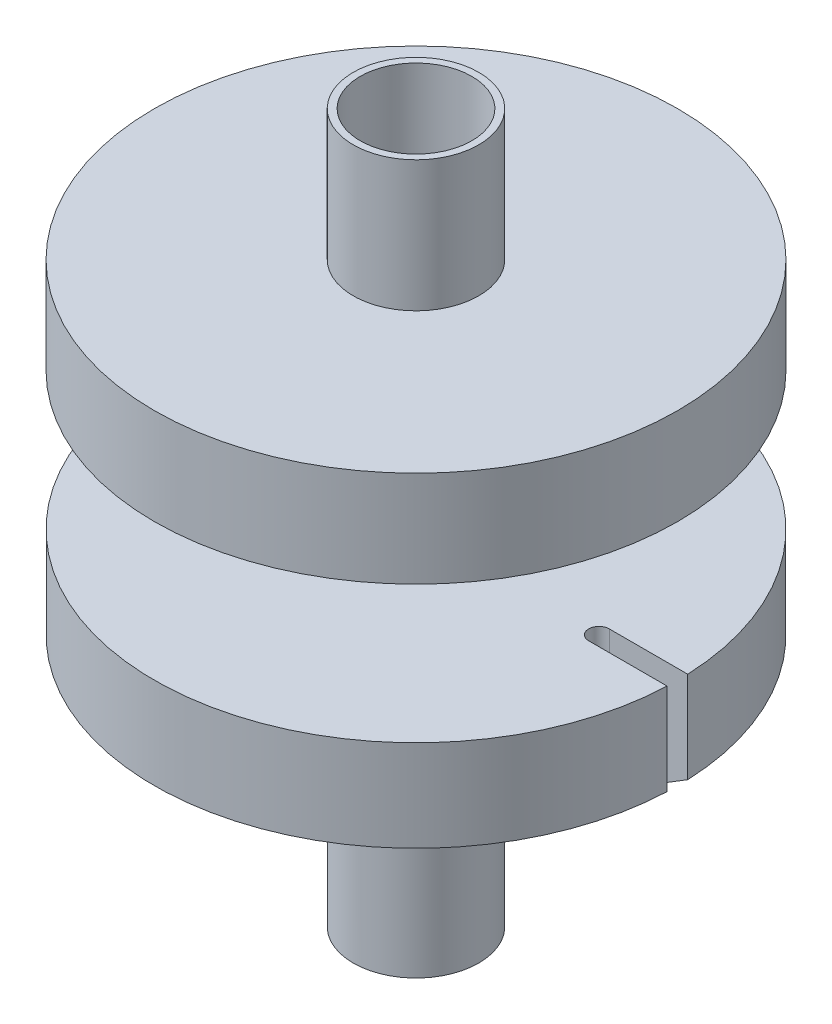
ISO-10303-21;
HEADER;
FILE_DESCRIPTION(('STEP AP214'),'2;1');
FILE_NAME('part.step','',(''),(''),'','','');
FILE_SCHEMA(('AUTOMOTIVE_DESIGN { 1 0 10303 214 1 1 1 1 }'));
ENDSEC;
DATA;
#1=APPLICATION_CONTEXT('core data for automotive mechanical design processes');
#2=APPLICATION_PROTOCOL_DEFINITION('international standard','automotive_design',2000,#1);
#3=PRODUCT_CONTEXT('',#1,'mechanical');
#4=PRODUCT('Part','Part','',(#3));
#5=PRODUCT_RELATED_PRODUCT_CATEGORY('part','',(#4));
#6=PRODUCT_DEFINITION_FORMATION('','',#4);
#7=PRODUCT_DEFINITION_CONTEXT('part definition',#1,'design');
#8=PRODUCT_DEFINITION('design','',#6,#7);
#9=PRODUCT_DEFINITION_SHAPE('','',#8);
#10=(LENGTH_UNIT() NAMED_UNIT(*) SI_UNIT(.MILLI.,.METRE.));
#11=(NAMED_UNIT(*) PLANE_ANGLE_UNIT() SI_UNIT($,.RADIAN.));
#12=(NAMED_UNIT(*) SI_UNIT($,.STERADIAN.) SOLID_ANGLE_UNIT());
#13=UNCERTAINTY_MEASURE_WITH_UNIT(LENGTH_MEASURE(1.E-05),#10,'distance_accuracy_value','');
#14=(GEOMETRIC_REPRESENTATION_CONTEXT(3) GLOBAL_UNCERTAINTY_ASSIGNED_CONTEXT((#13)) GLOBAL_UNIT_ASSIGNED_CONTEXT((#10,
#11,#12)) REPRESENTATION_CONTEXT('',''));
#15=CARTESIAN_POINT('',(0.,0.,0.));
#16=DIRECTION('',(0.,0.,1.));
#17=DIRECTION('',(1.,0.,0.));
#18=AXIS2_PLACEMENT_3D('',#15,#16,#17);
#19=CARTESIAN_POINT('',(5.322,-0.001000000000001,0.));
#20=DIRECTION('',(0.,1.,0.));
#21=DIRECTION('',(0.,0.,1.));
#22=AXIS2_PLACEMENT_3D('',#19,#20,#21);
#23=CYLINDRICAL_SURFACE('',#22,0.750000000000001);
#24=CARTESIAN_POINT('',(5.322,25.075,0.));
#25=DIRECTION('',(0.,1.,0.));
#26=DIRECTION('',(0.,0.,1.));
#27=AXIS2_PLACEMENT_3D('',#24,#25,#26);
#28=CIRCLE('',#27,0.750000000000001);
#29=CARTESIAN_POINT('',(4.73906334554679,25.075,-0.471894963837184));
#30=VERTEX_POINT('',#29);
#31=CARTESIAN_POINT('',(4.73906334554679,25.075,0.471894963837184));
#32=VERTEX_POINT('',#31);
#33=EDGE_CURVE('E400',#30,#32,#28,.T.);
#34=ORIENTED_EDGE('',*,*,#33,.T.);
#35=EDGE_CURVE('E417',#32,#30,#28,.T.);
#36=ORIENTED_EDGE('',*,*,#35,.T.);
#37=EDGE_LOOP('',(#34,#36));
#38=FACE_BOUND('',#37,.T.);
#39=DIRECTION('',(0.,1.,0.));
#40=VECTOR('',#39,1.);
#41=CARTESIAN_POINT('',(5.322,-0.00100000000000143,-0.749999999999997));
#42=LINE('',#41,#40);
#43=CARTESIAN_POINT('',(5.322,13.33998,-0.75));
#44=VERTEX_POINT('',#43);
#45=CARTESIAN_POINT('',(5.322,14.08998,-0.75));
#46=VERTEX_POINT('',#45);
#47=EDGE_CURVE('E372',#44,#46,#42,.T.);
#48=ORIENTED_EDGE('',*,*,#47,.T.);
#49=CARTESIAN_POINT('',(5.322,14.08998,0.));
#50=DIRECTION('',(0.707106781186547,-0.707106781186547,0.));
#51=DIRECTION('',(0.707106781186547,0.707106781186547,0.));
#52=AXIS2_PLACEMENT_3D('',#49,#50,#51);
#53=ELLIPSE('',#52,1.06066017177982,0.750000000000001);
#54=CARTESIAN_POINT('',(5.322,14.08998,0.75));
#55=VERTEX_POINT('',#54);
#56=EDGE_CURVE('E379',#55,#46,#53,.F.);
#57=ORIENTED_EDGE('',*,*,#56,.F.);
#58=DIRECTION('',(0.,1.,0.));
#59=VECTOR('',#58,1.);
#60=CARTESIAN_POINT('',(5.322,-0.00100000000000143,0.749999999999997));
#61=LINE('',#60,#59);
#62=CARTESIAN_POINT('',(5.322,13.33998,0.750000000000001));
#63=VERTEX_POINT('',#62);
#64=EDGE_CURVE('E386',#63,#55,#61,.T.);
#65=ORIENTED_EDGE('',*,*,#64,.F.);
#66=CARTESIAN_POINT('',(5.322,13.33998,0.));
#67=DIRECTION('',(0.,-1.,0.));
#68=DIRECTION('',(0.,0.,-1.));
#69=AXIS2_PLACEMENT_3D('',#66,#67,#68);
#70=CIRCLE('',#69,0.750000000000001);
#71=CARTESIAN_POINT('',(4.572,13.33998,0.));
#72=VERTEX_POINT('',#71);
#73=EDGE_CURVE('E418',#72,#63,#70,.F.);
#74=ORIENTED_EDGE('',*,*,#73,.F.);
#75=EDGE_CURVE('E390',#44,#72,#70,.F.);
#76=ORIENTED_EDGE('',*,*,#75,.F.);
#77=EDGE_LOOP('',(#48,#57,#65,#74,#76));
#78=FACE_BOUND('',#77,.T.);
#79=ADVANCED_FACE('F283',(#38,#78),#23,.F.);
#80=CARTESIAN_POINT('',(0.,51.6,0.));
#81=DIRECTION('',(0.,-1.,0.));
#82=DIRECTION('',(0.,0.,-1.));
#83=AXIS2_PLACEMENT_3D('',#80,#81,#82);
#84=CYLINDRICAL_SURFACE('',#83,4.572);
#85=CARTESIAN_POINT('',(0.,13.33998,0.));
#86=DIRECTION('',(0.,1.,0.));
#87=DIRECTION('',(0.,0.,1.));
#88=AXIS2_PLACEMENT_3D('',#85,#86,#87);
#89=CIRCLE('',#88,4.572);
#90=EDGE_CURVE('E429',#72,#72,#89,.T.);
#91=ORIENTED_EDGE('',*,*,#90,.F.);
#92=EDGE_LOOP('',(#91));
#93=FACE_BOUND('',#92,.T.);
#94=CARTESIAN_POINT('',(0.,0.,0.));
#95=DIRECTION('',(0.,1.,0.));
#96=DIRECTION('',(0.,0.,1.));
#97=AXIS2_PLACEMENT_3D('',#94,#95,#96);
#98=CIRCLE('',#97,4.572);
#99=CARTESIAN_POINT('',(0.,0.,4.572));
#100=VERTEX_POINT('',#99);
#101=EDGE_CURVE('E440',#100,#100,#98,.T.);
#102=ORIENTED_EDGE('',*,*,#101,.T.);
#103=EDGE_LOOP('',(#102));
#104=FACE_BOUND('',#103,.T.);
#105=ADVANCED_FACE('F524',(#93,#104),#84,.T.);
#106=CARTESIAN_POINT('',(0.,25.2655,0.));
#107=DIRECTION('',(0.,1.,0.));
#108=DIRECTION('',(0.,0.,1.));
#109=AXIS2_PLACEMENT_3D('',#106,#107,#108);
#110=CIRCLE('',#109,4.572);
#111=CARTESIAN_POINT('',(0.,25.2655,-4.572));
#112=VERTEX_POINT('',#111);
#113=EDGE_CURVE('E450',#112,#112,#110,.T.);
#114=CARTESIAN_POINT('',(0.,34.8845,0.));
#115=DIRECTION('',(0.,-1.,0.));
#116=DIRECTION('',(0.,0.,-1.));
#117=AXIS2_PLACEMENT_3D('',#114,#115,#116);
#118=CIRCLE('',#117,4.572);
#119=CARTESIAN_POINT('',(0.,34.8845,-4.572));
#120=VERTEX_POINT('',#119);
#121=EDGE_CURVE('E443',#120,#120,#118,.T.);
#122=CARTESIAN_POINT('',(0.,25.2655,-4.572));
#123=CARTESIAN_POINT('',(0.,25.3656979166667,-4.572));
#124=CARTESIAN_POINT('',(0.,25.4658958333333,-4.572));
#125=CARTESIAN_POINT('',(0.,25.6662916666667,-4.572));
#126=CARTESIAN_POINT('',(0.,25.7664895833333,-4.572));
#127=CARTESIAN_POINT('',(0.,25.9668854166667,-4.572));
#128=CARTESIAN_POINT('',(0.,26.0670833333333,-4.572));
#129=CARTESIAN_POINT('',(0.,26.2674791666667,-4.572));
#130=CARTESIAN_POINT('',(0.,26.3676770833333,-4.572));
#131=CARTESIAN_POINT('',(0.,26.5680729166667,-4.572));
#132=CARTESIAN_POINT('',(0.,26.6682708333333,-4.572));
#133=CARTESIAN_POINT('',(0.,26.8686666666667,-4.572));
#134=CARTESIAN_POINT('',(0.,26.9688645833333,-4.572));
#135=CARTESIAN_POINT('',(0.,27.1692604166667,-4.572));
#136=CARTESIAN_POINT('',(0.,27.2694583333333,-4.572));
#137=CARTESIAN_POINT('',(0.,27.4698541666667,-4.572));
#138=CARTESIAN_POINT('',(0.,27.5700520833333,-4.572));
#139=CARTESIAN_POINT('',(0.,27.7704479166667,-4.572));
#140=CARTESIAN_POINT('',(0.,27.8706458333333,-4.572));
#141=CARTESIAN_POINT('',(0.,28.0710416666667,-4.572));
#142=CARTESIAN_POINT('',(0.,28.1712395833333,-4.572));
#143=CARTESIAN_POINT('',(0.,28.3716354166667,-4.572));
#144=CARTESIAN_POINT('',(0.,28.4718333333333,-4.572));
#145=CARTESIAN_POINT('',(0.,28.6722291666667,-4.572));
#146=CARTESIAN_POINT('',(0.,28.7724270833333,-4.572));
#147=CARTESIAN_POINT('',(0.,28.9728229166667,-4.572));
#148=CARTESIAN_POINT('',(0.,29.0730208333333,-4.572));
#149=CARTESIAN_POINT('',(0.,29.2734166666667,-4.572));
#150=CARTESIAN_POINT('',(0.,29.3736145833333,-4.572));
#151=CARTESIAN_POINT('',(0.,29.5740104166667,-4.572));
#152=CARTESIAN_POINT('',(0.,29.6742083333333,-4.572));
#153=CARTESIAN_POINT('',(0.,29.8746041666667,-4.572));
#154=CARTESIAN_POINT('',(0.,29.9748020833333,-4.572));
#155=CARTESIAN_POINT('',(0.,30.1751979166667,-4.572));
#156=CARTESIAN_POINT('',(0.,30.2753958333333,-4.572));
#157=CARTESIAN_POINT('',(0.,30.4757916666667,-4.572));
#158=CARTESIAN_POINT('',(0.,30.5759895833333,-4.572));
#159=CARTESIAN_POINT('',(0.,30.7763854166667,-4.572));
#160=CARTESIAN_POINT('',(0.,30.8765833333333,-4.572));
#161=CARTESIAN_POINT('',(0.,31.0769791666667,-4.572));
#162=CARTESIAN_POINT('',(0.,31.1771770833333,-4.572));
#163=CARTESIAN_POINT('',(0.,31.3775729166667,-4.572));
#164=CARTESIAN_POINT('',(0.,31.4777708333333,-4.572));
#165=CARTESIAN_POINT('',(0.,31.6781666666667,-4.572));
#166=CARTESIAN_POINT('',(0.,31.7783645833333,-4.572));
#167=CARTESIAN_POINT('',(0.,31.9787604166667,-4.572));
#168=CARTESIAN_POINT('',(0.,32.0789583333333,-4.572));
#169=CARTESIAN_POINT('',(0.,32.2793541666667,-4.572));
#170=CARTESIAN_POINT('',(0.,32.3795520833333,-4.572));
#171=CARTESIAN_POINT('',(0.,32.5799479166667,-4.572));
#172=CARTESIAN_POINT('',(0.,32.6801458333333,-4.572));
#173=CARTESIAN_POINT('',(0.,32.8805416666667,-4.572));
#174=CARTESIAN_POINT('',(0.,32.9807395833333,-4.572));
#175=CARTESIAN_POINT('',(0.,33.1811354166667,-4.572));
#176=CARTESIAN_POINT('',(0.,33.2813333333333,-4.572));
#177=CARTESIAN_POINT('',(0.,33.4817291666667,-4.572));
#178=CARTESIAN_POINT('',(0.,33.5819270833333,-4.572));
#179=CARTESIAN_POINT('',(0.,33.7823229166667,-4.572));
#180=CARTESIAN_POINT('',(0.,33.8825208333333,-4.572));
#181=CARTESIAN_POINT('',(0.,34.0829166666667,-4.572));
#182=CARTESIAN_POINT('',(0.,34.1831145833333,-4.572));
#183=CARTESIAN_POINT('',(0.,34.3835104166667,-4.572));
#184=CARTESIAN_POINT('',(0.,34.4837083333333,-4.572));
#185=CARTESIAN_POINT('',(0.,34.6841041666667,-4.572));
#186=CARTESIAN_POINT('',(0.,34.7843020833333,-4.572));
#187=CARTESIAN_POINT('',(0.,34.8845,-4.572));
#188=B_SPLINE_CURVE_WITH_KNOTS('',3,(#122,#123,#124,#125,#126,#127,#128,#129,#130,#131,#132,
#133,#134,#135,#136,#137,#138,#139,#140,#141,#142,#143,#144,#145,#146,#147,#148,#149,#150,#151,
#152,#153,#154,#155,#156,#157,#158,#159,#160,#161,#162,#163,#164,#165,#166,#167,#168,#169,#170,
#171,#172,#173,#174,#175,#176,#177,#178,#179,#180,#181,#182,#183,#184,#185,#186,#187),
.UNSPECIFIED.,.F.,.F.,(4,2,2,2,2,2,2,2,2,2,2,2,2,2,2,2,2,2,2,2,2,2,2,2,2,2,2,2,2,2,2,2,4),(0.,
0.300593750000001,0.601187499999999,0.901781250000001,1.202375,1.50296875,1.8035625,2.10415625,
2.40475,2.70534375,3.0059375,3.30653125,3.607125,3.90771875,4.2083125,4.50890625,4.8095,
5.11009375,5.4106875,5.71128125,6.011875,6.31246875,6.6130625,6.91365625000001,7.21425,
7.51484375,7.8154375,8.11603125,8.41662500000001,8.71721875,9.0178125,9.31840625,9.619),.UNSPECIFIED.);
#189=EDGE_CURVE('BSEAM529',#112,#120,#188,.T.);
#190=ORIENTED_EDGE('',*,*,#113,.T.);
#191=ORIENTED_EDGE('',*,*,#121,.T.);
#192=ORIENTED_EDGE('',*,*,#189,.T.);
#193=ORIENTED_EDGE('',*,*,#189,.F.);
#194=EDGE_LOOP('',(#190,#192,#191,#193));
#195=FACE_BOUND('',#194,.T.);
#196=ADVANCED_FACE('F529',(#195),#84,.T.);
#197=CARTESIAN_POINT('',(0.,51.6,0.));
#198=DIRECTION('',(0.,-1.,0.));
#199=DIRECTION('',(0.,0.,-1.));
#200=AXIS2_PLACEMENT_3D('',#197,#198,#199);
#201=CYLINDRICAL_SURFACE('',#200,4.064);
#202=CARTESIAN_POINT('',(0.,51.6,0.));
#203=DIRECTION('',(0.,1.,0.));
#204=DIRECTION('',(0.,0.,1.));
#205=AXIS2_PLACEMENT_3D('',#202,#203,#204);
#206=CIRCLE('',#205,4.064);
#207=CARTESIAN_POINT('',(0.,51.6,-4.064));
#208=VERTEX_POINT('',#207);
#209=EDGE_CURVE('E436',#208,#208,#206,.T.);
#210=CARTESIAN_POINT('',(0.,0.,0.));
#211=DIRECTION('',(0.,1.,0.));
#212=DIRECTION('',(0.,0.,1.));
#213=AXIS2_PLACEMENT_3D('',#210,#211,#212);
#214=CIRCLE('',#213,4.064);
#215=CARTESIAN_POINT('',(0.,0.,-4.064));
#216=VERTEX_POINT('',#215);
#217=EDGE_CURVE('E435',#216,#216,#214,.T.);
#218=CARTESIAN_POINT('',(0.,51.6,-4.064));
#219=CARTESIAN_POINT('',(0.,51.0625,-4.064));
#220=CARTESIAN_POINT('',(0.,50.525,-4.064));
#221=CARTESIAN_POINT('',(0.,49.45,-4.064));
#222=CARTESIAN_POINT('',(0.,48.9125,-4.064));
#223=CARTESIAN_POINT('',(0.,47.8375,-4.064));
#224=CARTESIAN_POINT('',(0.,47.3,-4.064));
#225=CARTESIAN_POINT('',(0.,46.225,-4.064));
#226=CARTESIAN_POINT('',(0.,45.6875,-4.064));
#227=CARTESIAN_POINT('',(0.,44.6125,-4.064));
#228=CARTESIAN_POINT('',(0.,44.075,-4.064));
#229=CARTESIAN_POINT('',(0.,43.,-4.064));
#230=CARTESIAN_POINT('',(0.,42.4625,-4.064));
#231=CARTESIAN_POINT('',(0.,41.3875,-4.064));
#232=CARTESIAN_POINT('',(0.,40.85,-4.064));
#233=CARTESIAN_POINT('',(0.,39.775,-4.064));
#234=CARTESIAN_POINT('',(0.,39.2375,-4.064));
#235=CARTESIAN_POINT('',(0.,38.1625,-4.064));
#236=CARTESIAN_POINT('',(0.,37.625,-4.064));
#237=CARTESIAN_POINT('',(0.,36.55,-4.064));
#238=CARTESIAN_POINT('',(0.,36.0125,-4.064));
#239=CARTESIAN_POINT('',(0.,34.9375,-4.064));
#240=CARTESIAN_POINT('',(0.,34.4,-4.064));
#241=CARTESIAN_POINT('',(0.,33.325,-4.064));
#242=CARTESIAN_POINT('',(0.,32.7875,-4.064));
#243=CARTESIAN_POINT('',(0.,31.7125,-4.064));
#244=CARTESIAN_POINT('',(0.,31.175,-4.064));
#245=CARTESIAN_POINT('',(0.,30.1,-4.064));
#246=CARTESIAN_POINT('',(0.,29.5625,-4.064));
#247=CARTESIAN_POINT('',(0.,28.4875,-4.064));
#248=CARTESIAN_POINT('',(0.,27.95,-4.064));
#249=CARTESIAN_POINT('',(0.,26.875,-4.064));
#250=CARTESIAN_POINT('',(0.,26.3375,-4.064));
#251=CARTESIAN_POINT('',(0.,25.2625,-4.064));
#252=CARTESIAN_POINT('',(0.,24.725,-4.064));
#253=CARTESIAN_POINT('',(0.,23.65,-4.064));
#254=CARTESIAN_POINT('',(0.,23.1125,-4.064));
#255=CARTESIAN_POINT('',(0.,22.0375,-4.064));
#256=CARTESIAN_POINT('',(0.,21.5,-4.064));
#257=CARTESIAN_POINT('',(0.,20.425,-4.064));
#258=CARTESIAN_POINT('',(0.,19.8875,-4.064));
#259=CARTESIAN_POINT('',(0.,18.8125,-4.064));
#260=CARTESIAN_POINT('',(0.,18.275,-4.064));
#261=CARTESIAN_POINT('',(0.,17.2,-4.064));
#262=CARTESIAN_POINT('',(0.,16.6625,-4.064));
#263=CARTESIAN_POINT('',(0.,15.5875,-4.064));
#264=CARTESIAN_POINT('',(0.,15.05,-4.064));
#265=CARTESIAN_POINT('',(0.,13.975,-4.064));
#266=CARTESIAN_POINT('',(0.,13.4375,-4.064));
#267=CARTESIAN_POINT('',(0.,12.3625,-4.064));
#268=CARTESIAN_POINT('',(0.,11.825,-4.064));
#269=CARTESIAN_POINT('',(0.,10.75,-4.064));
#270=CARTESIAN_POINT('',(0.,10.2125,-4.064));
#271=CARTESIAN_POINT('',(0.,9.1375,-4.064));
#272=CARTESIAN_POINT('',(0.,8.6,-4.064));
#273=CARTESIAN_POINT('',(0.,7.525,-4.064));
#274=CARTESIAN_POINT('',(0.,6.9875,-4.064));
#275=CARTESIAN_POINT('',(0.,5.9125,-4.064));
#276=CARTESIAN_POINT('',(0.,5.375,-4.064));
#277=CARTESIAN_POINT('',(0.,4.3,-4.064));
#278=CARTESIAN_POINT('',(0.,3.7625,-4.064));
#279=CARTESIAN_POINT('',(0.,2.6875,-4.064));
#280=CARTESIAN_POINT('',(0.,2.15,-4.064));
#281=CARTESIAN_POINT('',(0.,1.075,-4.064));
#282=CARTESIAN_POINT('',(0.,0.537500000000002,-4.064));
#283=CARTESIAN_POINT('',(0.,0.,-4.064));
#284=B_SPLINE_CURVE_WITH_KNOTS('',3,(#218,#219,#220,#221,#222,#223,#224,#225,#226,#227,#228,
#229,#230,#231,#232,#233,#234,#235,#236,#237,#238,#239,#240,#241,#242,#243,#244,#245,#246,#247,
#248,#249,#250,#251,#252,#253,#254,#255,#256,#257,#258,#259,#260,#261,#262,#263,#264,#265,#266,
#267,#268,#269,#270,#271,#272,#273,#274,#275,#276,#277,#278,#279,#280,#281,#282,#283),
.UNSPECIFIED.,.F.,.F.,(4,2,2,2,2,2,2,2,2,2,2,2,2,2,2,2,2,2,2,2,2,2,2,2,2,2,2,2,2,2,2,2,4),(0.,
1.6125,3.22500000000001,4.8375,6.45,8.0625,9.675,11.2875,12.9,14.5125,16.125,17.7375,19.35,
20.9625,22.575,24.1875,25.8,27.4125,29.025,30.6375,32.25,33.8625,35.475,37.0875,38.7,40.3125,
41.925,43.5375,45.15,46.7625,48.375,49.9875,51.6),.UNSPECIFIED.);
#285=EDGE_CURVE('BSEAM568',#208,#216,#284,.T.);
#286=ORIENTED_EDGE('',*,*,#209,.T.);
#287=ORIENTED_EDGE('',*,*,#217,.F.);
#288=ORIENTED_EDGE('',*,*,#285,.T.);
#289=ORIENTED_EDGE('',*,*,#285,.F.);
#290=EDGE_LOOP('',(#286,#288,#287,#289));
#291=FACE_BOUND('',#290,.T.);
#292=ADVANCED_FACE('F568',(#291),#201,.F.);
#293=CARTESIAN_POINT('',(0.,42.075,0.));
#294=DIRECTION('',(0.,1.,0.));
#295=DIRECTION('',(0.,0.,1.));
#296=AXIS2_PLACEMENT_3D('',#293,#294,#295);
#297=CIRCLE('',#296,4.572);
#298=CARTESIAN_POINT('',(0.,42.075,-4.572));
#299=VERTEX_POINT('',#298);
#300=EDGE_CURVE('E432',#299,#299,#297,.T.);
#301=CARTESIAN_POINT('',(0.,51.6,0.));
#302=DIRECTION('',(0.,1.,0.));
#303=DIRECTION('',(0.,0.,1.));
#304=AXIS2_PLACEMENT_3D('',#301,#302,#303);
#305=CIRCLE('',#304,4.572);
#306=CARTESIAN_POINT('',(0.,51.6,-4.572));
#307=VERTEX_POINT('',#306);
#308=EDGE_CURVE('E439',#307,#307,#305,.T.);
#309=CARTESIAN_POINT('',(0.,42.075,-4.572));
#310=CARTESIAN_POINT('',(0.,42.17421875,-4.572));
#311=CARTESIAN_POINT('',(0.,42.2734375,-4.572));
#312=CARTESIAN_POINT('',(0.,42.471875,-4.572));
#313=CARTESIAN_POINT('',(0.,42.57109375,-4.572));
#314=CARTESIAN_POINT('',(0.,42.76953125,-4.572));
#315=CARTESIAN_POINT('',(0.,42.86875,-4.572));
#316=CARTESIAN_POINT('',(0.,43.0671875,-4.572));
#317=CARTESIAN_POINT('',(0.,43.16640625,-4.572));
#318=CARTESIAN_POINT('',(0.,43.36484375,-4.572));
#319=CARTESIAN_POINT('',(0.,43.4640625,-4.572));
#320=CARTESIAN_POINT('',(0.,43.6625,-4.572));
#321=CARTESIAN_POINT('',(0.,43.76171875,-4.572));
#322=CARTESIAN_POINT('',(0.,43.96015625,-4.572));
#323=CARTESIAN_POINT('',(0.,44.059375,-4.572));
#324=CARTESIAN_POINT('',(0.,44.2578125,-4.572));
#325=CARTESIAN_POINT('',(0.,44.35703125,-4.572));
#326=CARTESIAN_POINT('',(0.,44.55546875,-4.572));
#327=CARTESIAN_POINT('',(0.,44.6546875,-4.572));
#328=CARTESIAN_POINT('',(0.,44.853125,-4.572));
#329=CARTESIAN_POINT('',(0.,44.95234375,-4.572));
#330=CARTESIAN_POINT('',(0.,45.15078125,-4.572));
#331=CARTESIAN_POINT('',(0.,45.25,-4.572));
#332=CARTESIAN_POINT('',(0.,45.4484375,-4.572));
#333=CARTESIAN_POINT('',(0.,45.54765625,-4.572));
#334=CARTESIAN_POINT('',(0.,45.74609375,-4.572));
#335=CARTESIAN_POINT('',(0.,45.8453125,-4.572));
#336=CARTESIAN_POINT('',(0.,46.04375,-4.572));
#337=CARTESIAN_POINT('',(0.,46.14296875,-4.572));
#338=CARTESIAN_POINT('',(0.,46.34140625,-4.572));
#339=CARTESIAN_POINT('',(0.,46.440625,-4.572));
#340=CARTESIAN_POINT('',(0.,46.6390625,-4.572));
#341=CARTESIAN_POINT('',(0.,46.73828125,-4.572));
#342=CARTESIAN_POINT('',(0.,46.93671875,-4.572));
#343=CARTESIAN_POINT('',(0.,47.0359375,-4.572));
#344=CARTESIAN_POINT('',(0.,47.234375,-4.572));
#345=CARTESIAN_POINT('',(0.,47.33359375,-4.572));
#346=CARTESIAN_POINT('',(0.,47.53203125,-4.572));
#347=CARTESIAN_POINT('',(0.,47.63125,-4.572));
#348=CARTESIAN_POINT('',(0.,47.8296875,-4.572));
#349=CARTESIAN_POINT('',(0.,47.92890625,-4.572));
#350=CARTESIAN_POINT('',(0.,48.12734375,-4.572));
#351=CARTESIAN_POINT('',(0.,48.2265625,-4.572));
#352=CARTESIAN_POINT('',(0.,48.425,-4.572));
#353=CARTESIAN_POINT('',(0.,48.52421875,-4.572));
#354=CARTESIAN_POINT('',(0.,48.72265625,-4.572));
#355=CARTESIAN_POINT('',(0.,48.821875,-4.572));
#356=CARTESIAN_POINT('',(0.,49.0203125,-4.572));
#357=CARTESIAN_POINT('',(0.,49.11953125,-4.572));
#358=CARTESIAN_POINT('',(0.,49.31796875,-4.572));
#359=CARTESIAN_POINT('',(0.,49.4171875,-4.572));
#360=CARTESIAN_POINT('',(0.,49.615625,-4.572));
#361=CARTESIAN_POINT('',(0.,49.71484375,-4.572));
#362=CARTESIAN_POINT('',(0.,49.91328125,-4.572));
#363=CARTESIAN_POINT('',(0.,50.0125,-4.572));
#364=CARTESIAN_POINT('',(0.,50.2109375,-4.572));
#365=CARTESIAN_POINT('',(0.,50.31015625,-4.572));
#366=CARTESIAN_POINT('',(0.,50.50859375,-4.572));
#367=CARTESIAN_POINT('',(0.,50.6078125,-4.572));
#368=CARTESIAN_POINT('',(0.,50.80625,-4.572));
#369=CARTESIAN_POINT('',(0.,50.90546875,-4.572));
#370=CARTESIAN_POINT('',(0.,51.10390625,-4.572));
#371=CARTESIAN_POINT('',(0.,51.203125,-4.572));
#372=CARTESIAN_POINT('',(0.,51.4015625,-4.572));
#373=CARTESIAN_POINT('',(0.,51.50078125,-4.572));
#374=CARTESIAN_POINT('',(0.,51.6,-4.572));
#375=B_SPLINE_CURVE_WITH_KNOTS('',3,(#309,#310,#311,#312,#313,#314,#315,#316,#317,#318,#319,
#320,#321,#322,#323,#324,#325,#326,#327,#328,#329,#330,#331,#332,#333,#334,#335,#336,#337,#338,
#339,#340,#341,#342,#343,#344,#345,#346,#347,#348,#349,#350,#351,#352,#353,#354,#355,#356,#357,
#358,#359,#360,#361,#362,#363,#364,#365,#366,#367,#368,#369,#370,#371,#372,#373,#374),
.UNSPECIFIED.,.F.,.F.,(4,2,2,2,2,2,2,2,2,2,2,2,2,2,2,2,2,2,2,2,2,2,2,2,2,2,2,2,2,2,2,2,4),(0.,
0.29765625,0.5953125,0.892968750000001,1.190625,1.48828125,1.7859375,2.08359375,2.38125,
2.67890625,2.9765625,3.27421875,3.571875,3.86953125,4.1671875,4.46484375,4.7625,5.06015625,
5.3578125,5.65546875,5.953125,6.25078125,6.5484375,6.84609375,7.14375,7.44140625,7.7390625,
8.03671875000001,8.334375,8.63203125,8.92968750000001,9.22734375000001,9.52500000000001),.UNSPECIFIED.);
#376=EDGE_CURVE('BSEAM532',#299,#307,#375,.T.);
#377=ORIENTED_EDGE('',*,*,#300,.T.);
#378=ORIENTED_EDGE('',*,*,#308,.F.);
#379=ORIENTED_EDGE('',*,*,#376,.T.);
#380=ORIENTED_EDGE('',*,*,#376,.F.);
#381=EDGE_LOOP('',(#377,#379,#378,#380));
#382=FACE_BOUND('',#381,.T.);
#383=ADVANCED_FACE('F532',(#382),#84,.T.);
#384=CARTESIAN_POINT('',(0.,51.6,0.));
#385=DIRECTION('',(0.,1.,0.));
#386=DIRECTION('',(0.,0.,1.));
#387=AXIS2_PLACEMENT_3D('',#384,#385,#386);
#388=PLANE('',#387);
#389=ORIENTED_EDGE('',*,*,#209,.F.);
#390=EDGE_LOOP('',(#389));
#391=FACE_BOUND('',#390,.T.);
#392=ORIENTED_EDGE('',*,*,#308,.T.);
#393=EDGE_LOOP('',(#392));
#394=FACE_BOUND('',#393,.T.);
#395=ADVANCED_FACE('F560',(#391,#394),#388,.T.);
#396=CARTESIAN_POINT('',(0.,0.,0.));
#397=DIRECTION('',(0.,1.,0.));
#398=DIRECTION('',(0.,0.,1.));
#399=AXIS2_PLACEMENT_3D('',#396,#397,#398);
#400=PLANE('',#399);
#401=ORIENTED_EDGE('',*,*,#217,.T.);
#402=EDGE_LOOP('',(#401));
#403=FACE_BOUND('',#402,.T.);
#404=ORIENTED_EDGE('',*,*,#101,.F.);
#405=EDGE_LOOP('',(#404));
#406=FACE_BOUND('',#405,.T.);
#407=ADVANCED_FACE('F558',(#403,#406),#400,.F.);
#408=CARTESIAN_POINT('',(0.,35.075,0.));
#409=DIRECTION('',(0.,-1.,0.));
#410=DIRECTION('',(0.,0.,-1.));
#411=AXIS2_PLACEMENT_3D('',#408,#409,#410);
#412=PLANE('',#411);
#413=CARTESIAN_POINT('',(0.,35.075,0.));
#414=DIRECTION('',(0.,-1.,0.));
#415=DIRECTION('',(0.,0.,-1.));
#416=AXIS2_PLACEMENT_3D('',#413,#414,#415);
#417=CIRCLE('',#416,4.7625);
#418=CARTESIAN_POINT('',(0.,35.075,-4.7625));
#419=VERTEX_POINT('',#418);
#420=EDGE_CURVE('E456',#419,#419,#417,.F.);
#421=ORIENTED_EDGE('',*,*,#420,.T.);
#422=EDGE_LOOP('',(#421));
#423=FACE_BOUND('',#422,.T.);
#424=CARTESIAN_POINT('',(0.,35.075,0.));
#425=DIRECTION('',(0.,1.,0.));
#426=DIRECTION('',(0.,0.,1.));
#427=AXIS2_PLACEMENT_3D('',#424,#425,#426);
#428=CIRCLE('',#427,19.05);
#429=CARTESIAN_POINT('',(0.,35.075,19.05));
#430=VERTEX_POINT('',#429);
#431=EDGE_CURVE('E423',#430,#430,#428,.T.);
#432=ORIENTED_EDGE('',*,*,#431,.F.);
#433=EDGE_LOOP('',(#432));
#434=FACE_BOUND('',#433,.T.);
#435=ADVANCED_FACE('F554',(#423,#434),#412,.T.);
#436=CARTESIAN_POINT('',(0.,42.075,0.));
#437=DIRECTION('',(0.,1.,0.));
#438=DIRECTION('',(0.,0.,1.));
#439=AXIS2_PLACEMENT_3D('',#436,#437,#438);
#440=PLANE('',#439);
#441=ORIENTED_EDGE('',*,*,#300,.F.);
#442=EDGE_LOOP('',(#441));
#443=FACE_BOUND('',#442,.T.);
#444=CARTESIAN_POINT('',(0.,42.075,0.));
#445=DIRECTION('',(0.,1.,0.));
#446=DIRECTION('',(0.,0.,1.));
#447=AXIS2_PLACEMENT_3D('',#444,#445,#446);
#448=CIRCLE('',#447,19.05);
#449=CARTESIAN_POINT('',(0.,42.075,19.05));
#450=VERTEX_POINT('',#449);
#451=EDGE_CURVE('E426',#450,#450,#448,.T.);
#452=ORIENTED_EDGE('',*,*,#451,.T.);
#453=EDGE_LOOP('',(#452));
#454=FACE_BOUND('',#453,.T.);
#455=ADVANCED_FACE('F550',(#443,#454),#440,.T.);
#456=CARTESIAN_POINT('',(0.,13.33998,0.));
#457=DIRECTION('',(0.,-1.,0.));
#458=DIRECTION('',(0.,0.,-1.));
#459=AXIS2_PLACEMENT_3D('',#456,#457,#458);
#460=PLANE('',#459);
#461=DIRECTION('',(1.,0.,0.));
#462=VECTOR('',#461,1.);
#463=CARTESIAN_POINT('',(-19.051,13.33998,-0.75));
#464=LINE('',#463,#462);
#465=CARTESIAN_POINT('',(10.7689147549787,13.33998,-0.75));
#466=VERTEX_POINT('',#465);
#467=EDGE_CURVE('E376',#44,#466,#464,.T.);
#468=ORIENTED_EDGE('',*,*,#467,.F.);
#469=ORIENTED_EDGE('',*,*,#75,.T.);
#470=ORIENTED_EDGE('',*,*,#90,.T.);
#471=ORIENTED_EDGE('',*,*,#73,.T.);
#472=DIRECTION('',(1.,0.,0.));
#473=VECTOR('',#472,1.);
#474=CARTESIAN_POINT('',(-19.051,13.33998,0.75));
#475=LINE('',#474,#473);
#476=CARTESIAN_POINT('',(10.7689147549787,13.33998,0.75));
#477=VERTEX_POINT('',#476);
#478=EDGE_CURVE('E792',#63,#477,#475,.T.);
#479=ORIENTED_EDGE('',*,*,#478,.T.);
#480=CARTESIAN_POINT('',(0.,13.33998,0.));
#481=DIRECTION('',(0.,-1.,0.));
#482=DIRECTION('',(0.,0.,-1.));
#483=AXIS2_PLACEMENT_3D('',#480,#481,#482);
#484=CIRCLE('',#483,10.7949999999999);
#485=EDGE_CURVE('E500',#477,#466,#484,.T.);
#486=ORIENTED_EDGE('',*,*,#485,.T.);
#487=EDGE_LOOP('',(#468,#469,#470,#471,#479,#486));
#488=FACE_BOUND('',#487,.T.);
#489=ADVANCED_FACE('F546',(#488),#460,.T.);
#490=CARTESIAN_POINT('',(0.,25.075,0.));
#491=DIRECTION('',(0.,1.,0.));
#492=DIRECTION('',(0.,0.,1.));
#493=AXIS2_PLACEMENT_3D('',#490,#491,#492);
#494=PLANE('',#493);
#495=DIRECTION('',(1.,0.,0.));
#496=VECTOR('',#495,1.);
#497=CARTESIAN_POINT('',(13.322,25.075,0.75));
#498=LINE('',#497,#496);
#499=CARTESIAN_POINT('',(13.322,25.075,0.75));
#500=VERTEX_POINT('',#499);
#501=CARTESIAN_POINT('',(19.0352304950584,25.075,0.75));
#502=VERTEX_POINT('',#501);
#503=EDGE_CURVE('E403',#500,#502,#498,.T.);
#504=ORIENTED_EDGE('',*,*,#503,.F.);
#505=CARTESIAN_POINT('',(13.322,25.075,0.));
#506=DIRECTION('',(0.,1.,0.));
#507=DIRECTION('',(0.,0.,1.));
#508=AXIS2_PLACEMENT_3D('',#505,#506,#507);
#509=CIRCLE('',#508,0.75);
#510=CARTESIAN_POINT('',(13.322,25.075,-0.75));
#511=VERTEX_POINT('',#510);
#512=EDGE_CURVE('E399',#511,#500,#509,.T.);
#513=ORIENTED_EDGE('',*,*,#512,.F.);
#514=DIRECTION('',(-1.,0.,0.));
#515=VECTOR('',#514,1.);
#516=CARTESIAN_POINT('',(13.322,25.075,-0.75));
#517=LINE('',#516,#515);
#518=CARTESIAN_POINT('',(19.0352304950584,25.075,-0.75));
#519=VERTEX_POINT('',#518);
#520=EDGE_CURVE('E396',#519,#511,#517,.T.);
#521=ORIENTED_EDGE('',*,*,#520,.F.);
#522=CARTESIAN_POINT('',(0.,25.075,0.));
#523=DIRECTION('',(0.,1.,0.));
#524=DIRECTION('',(0.,0.,1.));
#525=AXIS2_PLACEMENT_3D('',#522,#523,#524);
#526=CIRCLE('',#525,19.05);
#527=EDGE_CURVE('E409',#519,#502,#526,.T.);
#528=ORIENTED_EDGE('',*,*,#527,.T.);
#529=EDGE_LOOP('',(#504,#513,#521,#528));
#530=FACE_BOUND('',#529,.T.);
#531=ORIENTED_EDGE('',*,*,#35,.F.);
#532=CARTESIAN_POINT('',(0.,25.075,0.));
#533=DIRECTION('',(0.,1.,0.));
#534=DIRECTION('',(0.,0.,1.));
#535=AXIS2_PLACEMENT_3D('',#532,#533,#534);
#536=CIRCLE('',#535,4.7625);
#537=EDGE_CURVE('E453',#32,#30,#536,.F.);
#538=ORIENTED_EDGE('',*,*,#537,.T.);
#539=EDGE_LOOP('',(#531,#538));
#540=FACE_BOUND('',#539,.T.);
#541=ADVANCED_FACE('F542',(#530,#540),#494,.T.);
#542=CARTESIAN_POINT('',(0.,78.742259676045,0.));
#543=DIRECTION('',(0.,1.,0.));
#544=DIRECTION('',(0.,0.,1.));
#545=AXIS2_PLACEMENT_3D('',#542,#543,#544);
#546=CYLINDRICAL_SURFACE('',#545,19.05);
#547=ORIENTED_EDGE('',*,*,#451,.F.);
#548=EDGE_LOOP('',(#547));
#549=FACE_BOUND('',#548,.T.);
#550=ORIENTED_EDGE('',*,*,#431,.T.);
#551=EDGE_LOOP('',(#550));
#552=FACE_BOUND('',#551,.T.);
#553=ADVANCED_FACE('F538',(#549,#552),#546,.T.);
#554=CARTESIAN_POINT('',(0.,78.742259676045,0.));
#555=DIRECTION('',(0.,1.,0.));
#556=DIRECTION('',(0.,0.,1.));
#557=AXIS2_PLACEMENT_3D('',#554,#555,#556);
#558=CYLINDRICAL_SURFACE('',#557,19.05);
#559=DIRECTION('',(0.,1.,0.));
#560=VECTOR('',#559,1.);
#561=CARTESIAN_POINT('',(19.0352304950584,-0.001000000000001,-0.75));
#562=LINE('',#561,#560);
#563=CARTESIAN_POINT('',(19.0352304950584,18.41998,-0.75));
#564=VERTEX_POINT('',#563);
#565=EDGE_CURVE('E406',#564,#519,#562,.T.);
#566=ORIENTED_EDGE('',*,*,#565,.F.);
#567=CARTESIAN_POINT('',(0.,18.41998,0.));
#568=DIRECTION('',(0.,-1.,0.));
#569=DIRECTION('',(0.,0.,-1.));
#570=AXIS2_PLACEMENT_3D('',#567,#568,#569);
#571=CIRCLE('',#570,19.05);
#572=CARTESIAN_POINT('',(19.0352304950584,18.41998,0.75));
#573=VERTEX_POINT('',#572);
#574=EDGE_CURVE('E459',#564,#573,#571,.F.);
#575=ORIENTED_EDGE('',*,*,#574,.T.);
#576=DIRECTION('',(0.,1.,0.));
#577=VECTOR('',#576,1.);
#578=CARTESIAN_POINT('',(19.0352304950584,-0.001000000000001,0.75));
#579=LINE('',#578,#577);
#580=EDGE_CURVE('E407',#573,#502,#579,.T.);
#581=ORIENTED_EDGE('',*,*,#580,.T.);
#582=ORIENTED_EDGE('',*,*,#527,.F.);
#583=EDGE_LOOP('',(#566,#575,#581,#582));
#584=FACE_BOUND('',#583,.T.);
#585=ADVANCED_FACE('F534',(#584),#558,.T.);
#586=CARTESIAN_POINT('',(0.,25.2655,0.));
#587=DIRECTION('',(0.,1.,0.));
#588=DIRECTION('',(0.,0.,1.));
#589=AXIS2_PLACEMENT_3D('',#586,#587,#588);
#590=TOROIDAL_SURFACE('',#589,4.7625,0.1905);
#591=EDGE_CURVE('E454',#30,#32,#536,.F.);
#592=ORIENTED_EDGE('',*,*,#591,.F.);
#593=ORIENTED_EDGE('',*,*,#537,.F.);
#594=EDGE_LOOP('',(#592,#593));
#595=FACE_BOUND('',#594,.T.);
#596=ORIENTED_EDGE('',*,*,#113,.F.);
#597=EDGE_LOOP('',(#596));
#598=FACE_BOUND('',#597,.T.);
#599=ADVANCED_FACE('F537',(#595,#598),#590,.F.);
#600=CARTESIAN_POINT('',(0.,34.8845,0.));
#601=DIRECTION('',(0.,-1.,0.));
#602=DIRECTION('',(0.,0.,-1.));
#603=AXIS2_PLACEMENT_3D('',#600,#601,#602);
#604=TOROIDAL_SURFACE('',#603,4.7625,0.1905);
#605=ORIENTED_EDGE('',*,*,#121,.F.);
#606=EDGE_LOOP('',(#605));
#607=FACE_BOUND('',#606,.T.);
#608=ORIENTED_EDGE('',*,*,#420,.F.);
#609=EDGE_LOOP('',(#608));
#610=FACE_BOUND('',#609,.T.);
#611=ADVANCED_FACE('F574',(#607,#610),#604,.F.);
#612=CARTESIAN_POINT('',(5.322,25.075,0.));
#613=DIRECTION('',(0.,1.,0.));
#614=DIRECTION('',(0.,0.,1.));
#615=AXIS2_PLACEMENT_3D('',#612,#613,#614);
#616=PLANE('',#615);
#617=ORIENTED_EDGE('',*,*,#591,.T.);
#618=ORIENTED_EDGE('',*,*,#33,.F.);
#619=EDGE_LOOP('',(#617,#618));
#620=FACE_BOUND('',#619,.T.);
#621=ADVANCED_FACE('F481',(#620),#616,.F.);
#622=CARTESIAN_POINT('',(13.322,-0.001000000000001,0.75));
#623=DIRECTION('',(0.,0.,1.));
#624=DIRECTION('',(1.,0.,0.));
#625=AXIS2_PLACEMENT_3D('',#622,#623,#624);
#626=PLANE('',#625);
#627=ORIENTED_EDGE('',*,*,#580,.F.);
#628=CARTESIAN_POINT('',(19.0352304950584,18.41998,0.75));
#629=CARTESIAN_POINT('',(18.1087155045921,17.8502710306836,0.75));
#630=CARTESIAN_POINT('',(17.1821818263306,17.2805924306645,0.75));
#631=CARTESIAN_POINT('',(15.3290195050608,16.1413899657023,0.75));
#632=CARTESIAN_POINT('',(14.402390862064,15.5718661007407,0.75));
#633=CARTESIAN_POINT('',(12.548980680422,14.4330668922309,0.75));
#634=CARTESIAN_POINT('',(11.622199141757,13.863791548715,0.75));
#635=CARTESIAN_POINT('',(10.2317961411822,13.0102541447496,0.75));
#636=CARTESIAN_POINT('',(9.76828999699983,12.725804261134,0.75));
#637=CARTESIAN_POINT('',(8.84115264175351,12.1571083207,0.75));
#638=CARTESIAN_POINT('',(8.37752143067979,11.8728622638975,0.75));
#639=CARTESIAN_POINT('',(7.91380362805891,11.5887574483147,0.75));
#640=B_SPLINE_CURVE_WITH_KNOTS('',3,(#628,#629,#630,#631,#632,#633,#634,#635,#636,#637,#638,
#639),.UNSPECIFIED.,.F.,.F.,(4,2,2,2,2,4),(0.,3.2629718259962,6.52594326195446,9.78891512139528,
11.4204012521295,13.0518875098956),.UNSPECIFIED.);
#641=CARTESIAN_POINT('',(13.322,14.9080384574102,0.75));
#642=VERTEX_POINT('',#641);
#643=EDGE_CURVE('E462',#573,#642,#640,.T.);
#644=ORIENTED_EDGE('',*,*,#643,.T.);
#645=DIRECTION('',(0.,1.,0.));
#646=VECTOR('',#645,1.);
#647=CARTESIAN_POINT('',(13.322,-0.001000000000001,0.75));
#648=LINE('',#647,#646);
#649=EDGE_CURVE('E410',#642,#500,#648,.T.);
#650=ORIENTED_EDGE('',*,*,#649,.T.);
#651=ORIENTED_EDGE('',*,*,#503,.T.);
#652=EDGE_LOOP('',(#627,#644,#650,#651));
#653=FACE_BOUND('',#652,.T.);
#654=ADVANCED_FACE('F476',(#653),#626,.F.);
#655=CARTESIAN_POINT('',(13.322,-0.001000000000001,0.));
#656=DIRECTION('',(0.,1.,0.));
#657=DIRECTION('',(0.,0.,1.));
#658=AXIS2_PLACEMENT_3D('',#655,#656,#657);
#659=CYLINDRICAL_SURFACE('',#658,0.75);
#660=CARTESIAN_POINT('',(13.322,14.9080384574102,0.75));
#661=CARTESIAN_POINT('',(13.2677177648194,14.8746979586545,0.75000170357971));
#662=CARTESIAN_POINT('',(13.2134647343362,14.8411504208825,0.744103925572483));
#663=CARTESIAN_POINT('',(13.1066290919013,14.7746940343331,0.720506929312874));
#664=CARTESIAN_POINT('',(13.0540613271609,14.7417915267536,0.702723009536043));
#665=CARTESIAN_POINT('',(12.9583224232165,14.6815163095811,0.657826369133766));
#666=CARTESIAN_POINT('',(12.9147432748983,14.653924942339,0.631881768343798));
#667=CARTESIAN_POINT('',(12.8327477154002,14.6017651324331,0.57072859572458));
#668=CARTESIAN_POINT('',(12.794311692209,14.5771852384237,0.535556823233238));
#669=CARTESIAN_POINT('',(12.7342047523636,14.5385951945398,0.46739211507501));
#670=CARTESIAN_POINT('',(12.7108349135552,14.5235404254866,0.436478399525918));
#671=CARTESIAN_POINT('',(12.6687115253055,14.4963405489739,0.370464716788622));
#672=CARTESIAN_POINT('',(12.6499570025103,14.484194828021,0.335365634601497));
#673=CARTESIAN_POINT('',(12.6179021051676,14.4634004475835,0.261489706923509));
#674=CARTESIAN_POINT('',(12.6046367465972,14.4547742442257,0.222691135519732));
#675=CARTESIAN_POINT('',(12.5845683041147,14.441712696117,0.142783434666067));
#676=CARTESIAN_POINT('',(12.5777603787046,14.4372742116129,0.101676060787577));
#677=CARTESIAN_POINT('',(12.5714542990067,14.4331628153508,0.0233777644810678));
#678=CARTESIAN_POINT('',(12.5712163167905,14.433007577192,-0.0137301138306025));
#679=CARTESIAN_POINT('',(12.5761975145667,14.4362553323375,-0.0874125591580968));
#680=CARTESIAN_POINT('',(12.5814154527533,14.4396575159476,-0.123987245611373));
#681=CARTESIAN_POINT('',(12.5967036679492,14.4496123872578,-0.194124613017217));
#682=CARTESIAN_POINT('',(12.606577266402,14.4560373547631,-0.227749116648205));
#683=CARTESIAN_POINT('',(12.6306187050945,14.47165343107,-0.2927337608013));
#684=CARTESIAN_POINT('',(12.6447873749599,14.4808450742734,-0.324093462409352));
#685=CARTESIAN_POINT('',(12.6780062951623,14.5023465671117,-0.386131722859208));
#686=CARTESIAN_POINT('',(12.6973340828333,14.5148329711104,-0.416599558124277));
#687=CARTESIAN_POINT('',(12.7395531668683,14.5420302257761,-0.473837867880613));
#688=CARTESIAN_POINT('',(12.7624461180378,14.5567421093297,-0.500606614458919));
#689=CARTESIAN_POINT('',(12.8145569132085,14.5901242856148,-0.553690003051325));
#690=CARTESIAN_POINT('',(12.844211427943,14.6090602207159,-0.579408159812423));
#691=CARTESIAN_POINT('',(12.9063926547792,14.648610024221,-0.625516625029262));
#692=CARTESIAN_POINT('',(12.9389209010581,14.669224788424,-0.645904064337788));
#693=CARTESIAN_POINT('',(13.0113867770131,14.7149605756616,-0.684068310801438));
#694=CARTESIAN_POINT('',(13.0516840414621,14.7402796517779,-0.700926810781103));
#695=CARTESIAN_POINT('',(13.1340785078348,14.7917950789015,-0.727365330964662));
#696=CARTESIAN_POINT('',(13.1761770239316,14.8179920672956,-0.736939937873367));
#697=CARTESIAN_POINT('',(13.2662326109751,14.8737549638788,-0.749460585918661));
#698=CARTESIAN_POINT('',(13.314297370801,14.9033554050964,-0.751496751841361));
#699=CARTESIAN_POINT('',(13.4101780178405,14.9620923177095,-0.746342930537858));
#700=CARTESIAN_POINT('',(13.4579940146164,14.9912290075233,-0.73915742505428));
#701=CARTESIAN_POINT('',(13.5050444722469,15.0197433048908,-0.727320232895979));
#702=B_SPLINE_CURVE_WITH_KNOTS('',3,(#660,#661,#662,#663,#664,#665,#666,#667,#668,#669,#670,
#671,#672,#673,#674,#675,#676,#677,#678,#679,#680,#681,#682,#683,#684,#685,#686,#687,#688,#689,
#690,#691,#692,#693,#694,#695,#696,#697,#698,#699,#700,#701),.UNSPECIFIED.,.F.,.F.,(4,2,2,2,2,2,
2,2,2,2,2,2,2,2,2,2,2,2,2,2,4),(0.,0.190991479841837,0.383358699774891,0.555637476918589,
0.727239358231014,0.851465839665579,0.975666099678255,1.1006468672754,1.22553385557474,
1.33629229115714,1.44702552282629,1.55345066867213,1.65989638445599,1.77398799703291,
1.88813272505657,2.01837566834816,2.14868856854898,2.29954589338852,2.45051522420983,
2.61920354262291,2.7878099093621),.UNSPECIFIED.);
#703=CARTESIAN_POINT('',(12.8190221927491,14.5929578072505,0.556339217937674));
#704=VERTEX_POINT('',#703);
#705=EDGE_CURVE('E469',#642,#704,#702,.T.);
#706=ORIENTED_EDGE('',*,*,#705,.T.);
#707=CARTESIAN_POINT('',(13.322,14.08998,0.));
#708=DIRECTION('',(0.707106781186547,0.707106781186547,0.));
#709=DIRECTION('',(-0.707106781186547,0.707106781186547,0.));
#710=AXIS2_PLACEMENT_3D('',#707,#708,#709);
#711=ELLIPSE('',#710,1.06066017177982,0.75);
#712=CARTESIAN_POINT('',(12.8190221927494,14.5929578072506,-0.556339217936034));
#713=VERTEX_POINT('',#712);
#714=EDGE_CURVE('E305',#704,#713,#711,.F.);
#715=ORIENTED_EDGE('',*,*,#714,.T.);
#716=CARTESIAN_POINT('',(13.322,14.9080384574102,-0.75));
#717=VERTEX_POINT('',#716);
#718=EDGE_CURVE('E312',#713,#717,#702,.T.);
#719=ORIENTED_EDGE('',*,*,#718,.T.);
#720=DIRECTION('',(0.,1.,0.));
#721=VECTOR('',#720,1.);
#722=CARTESIAN_POINT('',(13.322,-0.001000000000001,-0.75));
#723=LINE('',#722,#721);
#724=EDGE_CURVE('E412',#717,#511,#723,.T.);
#725=ORIENTED_EDGE('',*,*,#724,.T.);
#726=ORIENTED_EDGE('',*,*,#512,.T.);
#727=ORIENTED_EDGE('',*,*,#649,.F.);
#728=EDGE_LOOP('',(#706,#715,#719,#725,#726,#727));
#729=FACE_BOUND('',#728,.T.);
#730=ADVANCED_FACE('F480',(#729),#659,.F.);
#731=CARTESIAN_POINT('',(13.322,-0.001000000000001,-0.75));
#732=DIRECTION('',(0.,0.,-1.));
#733=DIRECTION('',(-1.,0.,0.));
#734=AXIS2_PLACEMENT_3D('',#731,#732,#733);
#735=PLANE('',#734);
#736=ORIENTED_EDGE('',*,*,#724,.F.);
#737=CARTESIAN_POINT('',(13.322,14.9080384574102,-0.75));
#738=CARTESIAN_POINT('',(14.2487080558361,15.4774331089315,-0.75));
#739=CARTESIAN_POINT('',(15.1753462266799,16.046941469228,-0.75));
#740=CARTESIAN_POINT('',(17.0285246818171,17.1861174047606,-0.75));
#741=CARTESIAN_POINT('',(17.9550649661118,17.7557849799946,-0.75));
#742=CARTESIAN_POINT('',(19.8080895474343,18.89521115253,-0.75));
#743=CARTESIAN_POINT('',(20.7345738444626,19.4649697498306,-0.75));
#744=CARTESIAN_POINT('',(22.5875027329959,20.6045515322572,-0.75));
#745=CARTESIAN_POINT('',(23.5139473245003,21.1743747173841,-0.75));
#746=CARTESIAN_POINT('',(24.4403801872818,21.7442169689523,-0.75));
#747=B_SPLINE_CURVE_WITH_KNOTS('',3,(#737,#738,#739,#740,#741,#742,#743,#744,#745,#746),
.UNSPECIFIED.,.F.,.F.,(4,2,2,2,4),(0.,3.26297143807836,6.52594283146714,9.78891419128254,
13.051885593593),.UNSPECIFIED.);
#748=EDGE_CURVE('E494',#717,#564,#747,.T.);
#749=ORIENTED_EDGE('',*,*,#748,.T.);
#750=ORIENTED_EDGE('',*,*,#565,.T.);
#751=ORIENTED_EDGE('',*,*,#520,.T.);
#752=EDGE_LOOP('',(#736,#749,#750,#751));
#753=FACE_BOUND('',#752,.T.);
#754=ADVANCED_FACE('F488',(#753),#735,.F.);
#755=CARTESIAN_POINT('',(0.,18.41998,0.));
#756=DIRECTION('',(0.,1.,0.));
#757=DIRECTION('',(0.,0.,1.));
#758=AXIS2_PLACEMENT_3D('',#755,#756,#757);
#759=CONICAL_SURFACE('',#758,19.05,1.01914134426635);
#760=CARTESIAN_POINT('',(-0.0007,7.15844173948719,-0.749999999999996));
#761=CARTESIAN_POINT('',(0.0338705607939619,7.15838559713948,-0.749999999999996));
#762=CARTESIAN_POINT('',(0.0684199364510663,7.15987291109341,-0.749999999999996));
#763=CARTESIAN_POINT('',(0.137202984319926,7.16564275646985,-0.749999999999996));
#764=CARTESIAN_POINT('',(0.171437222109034,7.16991844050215,-0.749999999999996));
#765=CARTESIAN_POINT('',(0.239058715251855,7.18090615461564,-0.749999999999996));
#766=CARTESIAN_POINT('',(0.272451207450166,7.18758679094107,-0.749999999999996));
#767=CARTESIAN_POINT('',(0.338769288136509,7.20298867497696,-0.749999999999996));
#768=CARTESIAN_POINT('',(0.37169466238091,7.21171082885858,-0.749999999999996));
#769=CARTESIAN_POINT('',(0.466862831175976,7.23949662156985,-0.749999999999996));
#770=CARTESIAN_POINT('',(0.52846477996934,7.26073839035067,-0.749999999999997));
#771=CARTESIAN_POINT('',(0.650234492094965,7.30703904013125,-0.749999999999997));
#772=CARTESIAN_POINT('',(0.710400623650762,7.33210204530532,-0.749999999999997));
#773=CARTESIAN_POINT('',(0.829831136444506,7.38475439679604,-0.749999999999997));
#774=CARTESIAN_POINT('',(0.889092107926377,7.41235140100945,-0.749999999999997));
#775=CARTESIAN_POINT('',(1.00679527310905,7.46915758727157,-0.749999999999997));
#776=CARTESIAN_POINT('',(1.06523781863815,7.4983660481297,-0.749999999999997));
#777=CARTESIAN_POINT('',(1.18276336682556,7.55851733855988,-0.749999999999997));
#778=CARTESIAN_POINT('',(1.24183430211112,7.58948363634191,-0.749999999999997));
#779=CARTESIAN_POINT('',(1.35954447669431,7.65223670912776,-0.749999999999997));
#780=CARTESIAN_POINT('',(1.41818367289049,7.6840235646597,-0.749999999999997));
#781=CARTESIAN_POINT('',(1.53501376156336,7.74812511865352,-0.749999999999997));
#782=CARTESIAN_POINT('',(1.59320533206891,7.78043858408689,-0.749999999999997));
#783=CARTESIAN_POINT('',(1.70933716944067,7.84550821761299,-0.749999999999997));
#784=CARTESIAN_POINT('',(1.76727744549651,7.87826436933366,-0.749999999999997));
#785=CARTESIAN_POINT('',(1.93859844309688,7.97577622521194,-0.749999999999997));
#786=CARTESIAN_POINT('',(2.05170705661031,8.04100963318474,-0.749999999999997));
#787=CARTESIAN_POINT('',(2.2774560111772,8.17228258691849,-0.749999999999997));
#788=CARTESIAN_POINT('',(2.3900963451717,8.23832214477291,-0.749999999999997));
#789=CARTESIAN_POINT('',(2.72756158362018,8.43723875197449,-0.749999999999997));
#790=CARTESIAN_POINT('',(2.95191950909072,8.57090726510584,-0.749999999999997));
#791=CARTESIAN_POINT('',(3.40019671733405,8.83940357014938,-0.749999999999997));
#792=CARTESIAN_POINT('',(3.62411546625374,8.97423224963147,-0.749999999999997));
#793=CARTESIAN_POINT('',(4.07157342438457,9.24450432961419,-0.749999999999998));
#794=CARTESIAN_POINT('',(4.29511264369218,9.37994771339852,-0.749999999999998));
#795=CARTESIAN_POINT('',(4.73908558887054,9.64947593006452,-0.749999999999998));
#796=CARTESIAN_POINT('',(4.95952230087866,9.78355584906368,-0.749999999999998));
#797=CARTESIAN_POINT('',(5.40024277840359,10.051970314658,-0.749999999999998));
#798=CARTESIAN_POINT('',(5.62052654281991,10.1863048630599,-0.749999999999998));
#799=CARTESIAN_POINT('',(6.2811028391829,10.5894996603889,-0.749999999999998));
#800=CARTESIAN_POINT('',(6.72123580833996,10.8586212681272,-0.749999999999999));
#801=CARTESIAN_POINT('',(7.56160376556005,11.3729624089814,-0.749999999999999));
#802=CARTESIAN_POINT('',(7.96185858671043,11.6181495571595,-0.749999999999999));
#803=CARTESIAN_POINT('',(8.76227839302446,12.1087460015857,-0.749999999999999));
#804=CARTESIAN_POINT('',(9.16244336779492,12.3541553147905,-0.749999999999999));
#805=CARTESIAN_POINT('',(9.96746801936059,12.8480383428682,-0.75));
#806=CARTESIAN_POINT('',(10.3723267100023,13.0965136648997,-0.75));
#807=CARTESIAN_POINT('',(11.1819486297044,13.5935424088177,-0.75));
#808=CARTESIAN_POINT('',(11.5867118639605,13.8420958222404,-0.75));
#809=CARTESIAN_POINT('',(11.991456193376,14.09068,-0.75));
#810=B_SPLINE_CURVE_WITH_KNOTS('',3,(#760,#761,#762,#763,#764,#765,#766,#767,#768,#769,#770,
#771,#772,#773,#774,#775,#776,#777,#778,#779,#780,#781,#782,#783,#784,#785,#786,#787,#788,#789,
#790,#791,#792,#793,#794,#795,#796,#797,#798,#799,#800,#801,#802,#803,#804,#805,#806,#807,#808,
#809),.UNSPECIFIED.,.F.,.F.,(4,2,2,2,2,2,2,2,2,2,2,2,2,2,2,2,2,2,2,2,2,2,2,2,4),(0.,
0.103643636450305,0.207033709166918,0.30912037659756,0.411252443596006,0.606505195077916,
0.80197019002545,0.998046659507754,1.19403607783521,1.39411346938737,1.59421057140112,
1.79389220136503,1.99356646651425,2.38527510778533,2.77698963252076,3.56045752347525,
4.34459031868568,5.12870191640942,5.90273527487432,6.67677414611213,8.22444656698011,
9.6325963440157,11.0408646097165,12.4659452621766,13.8909044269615),.UNSPECIFIED.);
#811=CARTESIAN_POINT('',(11.9903164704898,14.08998,-0.75));
#812=VERTEX_POINT('',#811);
#813=EDGE_CURVE('E14',#466,#812,#810,.T.);
#814=ORIENTED_EDGE('',*,*,#813,.F.);
#815=ORIENTED_EDGE('',*,*,#485,.F.);
#816=CARTESIAN_POINT('',(11.991456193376,14.09068,0.75));
#817=CARTESIAN_POINT('',(11.3658827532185,13.7064870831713,0.75));
#818=CARTESIAN_POINT('',(10.7402778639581,13.322345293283,0.75));
#819=CARTESIAN_POINT('',(9.48887018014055,12.5543437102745,0.75));
#820=CARTESIAN_POINT('',(8.86306738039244,12.1704839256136,0.749999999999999));
#821=CARTESIAN_POINT('',(7.61972704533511,11.4084956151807,0.749999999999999));
#822=CARTESIAN_POINT('',(7.00219354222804,11.0303605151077,0.749999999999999));
#823=CARTESIAN_POINT('',(6.0754239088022,10.463942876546,0.749999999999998));
#824=CARTESIAN_POINT('',(5.76642630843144,10.2752701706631,0.749999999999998));
#825=CARTESIAN_POINT('',(5.14817441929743,9.89834615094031,0.749999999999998));
#826=CARTESIAN_POINT('',(4.83892013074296,9.7100948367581,0.749999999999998));
#827=CARTESIAN_POINT('',(4.29879103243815,9.38217282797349,0.749999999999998));
#828=CARTESIAN_POINT('',(4.06801440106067,9.24234058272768,0.749999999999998));
#829=CARTESIAN_POINT('',(3.6060474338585,8.96333354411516,0.749999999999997));
#830=CARTESIAN_POINT('',(3.37485707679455,8.82415878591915,0.749999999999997));
#831=CARTESIAN_POINT('',(2.91015843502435,8.54597581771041,0.749999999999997));
#832=CARTESIAN_POINT('',(2.67664529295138,8.40697568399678,0.749999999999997));
#833=CARTESIAN_POINT('',(2.32531103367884,8.20031068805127,0.749999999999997));
#834=CARTESIAN_POINT('',(2.20802841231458,8.13173179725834,0.749999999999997));
#835=CARTESIAN_POINT('',(1.9729078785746,7.99553414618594,0.749999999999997));
#836=CARTESIAN_POINT('',(1.85506997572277,7.92791536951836,0.749999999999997));
#837=CARTESIAN_POINT('',(1.64549893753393,7.80951793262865,0.749999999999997));
#838=CARTESIAN_POINT('',(1.55394760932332,7.75841887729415,0.749999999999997));
#839=CARTESIAN_POINT('',(1.37000903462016,7.65770277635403,0.749999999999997));
#840=CARTESIAN_POINT('',(1.27762163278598,7.60808601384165,0.749999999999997));
#841=CARTESIAN_POINT('',(1.09255931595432,7.51184475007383,0.749999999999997));
#842=CARTESIAN_POINT('',(0.999898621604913,7.46519343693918,0.749999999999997));
#843=CARTESIAN_POINT('',(0.859312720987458,7.39856185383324,0.749999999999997));
#844=CARTESIAN_POINT('',(0.81218488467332,7.37690886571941,0.749999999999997));
#845=CARTESIAN_POINT('',(0.717211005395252,7.33517865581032,0.749999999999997));
#846=CARTESIAN_POINT('',(0.669364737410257,7.31510194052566,0.749999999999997));
#847=CARTESIAN_POINT('',(0.571791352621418,7.27680413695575,0.749999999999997));
#848=CARTESIAN_POINT('',(0.522045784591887,7.25862948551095,0.749999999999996));
#849=CARTESIAN_POINT('',(0.421443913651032,7.2256709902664,0.749999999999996));
#850=CARTESIAN_POINT('',(0.370588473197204,7.21088460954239,0.749999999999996));
#851=CARTESIAN_POINT('',(0.293067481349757,7.19220706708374,0.749999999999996));
#852=CARTESIAN_POINT('',(0.266830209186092,7.18653745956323,0.749999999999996));
#853=CARTESIAN_POINT('',(0.214090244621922,7.17662829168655,0.749999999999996));
#854=CARTESIAN_POINT('',(0.187587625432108,7.1723883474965,0.749999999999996));
#855=CARTESIAN_POINT('',(0.134194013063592,7.16549551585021,0.749999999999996));
#856=CARTESIAN_POINT('',(0.107301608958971,7.16285338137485,0.749999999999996));
#857=CARTESIAN_POINT('',(0.0533749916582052,7.1593103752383,0.749999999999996));
#858=CARTESIAN_POINT('',(0.02634065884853,7.15841134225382,0.749999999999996));
#859=CARTESIAN_POINT('',(-0.000700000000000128,7.15844173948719,0.749999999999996));
#860=B_SPLINE_CURVE_WITH_KNOTS('',3,(#816,#817,#818,#819,#820,#821,#822,#823,#824,#825,#826,
#827,#828,#829,#830,#831,#832,#833,#834,#835,#836,#837,#838,#839,#840,#841,#842,#843,#844,#845,
#846,#847,#848,#849,#850,#851,#852,#853,#854,#855,#856,#857,#858,#859),.UNSPECIFIED.,.F.,.F.,(4,
2,2,2,2,2,2,2,2,2,2,2,2,2,2,2,2,2,2,2,2,4),(0.,2.2023889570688,4.40484148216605,
6.57716774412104,7.66330389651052,8.74943916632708,9.55894319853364,10.3684900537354,
11.1837384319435,11.5913195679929,11.9988937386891,12.3134230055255,12.6280119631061,
12.9391568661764,13.0947297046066,13.2503523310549,13.4091628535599,13.5678540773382,
13.6483501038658,13.7288245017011,13.8098346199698,13.8909301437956),.UNSPECIFIED.);
#861=CARTESIAN_POINT('',(11.9903164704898,14.08998,0.75));
#862=VERTEX_POINT('',#861);
#863=EDGE_CURVE('E508',#862,#477,#860,.T.);
#864=ORIENTED_EDGE('',*,*,#863,.F.);
#865=CARTESIAN_POINT('',(11.8681134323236,14.01478,-0.746220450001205));
#866=CARTESIAN_POINT('',(11.9219392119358,14.0479678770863,-0.749537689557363));
#867=CARTESIAN_POINT('',(11.9759028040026,14.0811531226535,-0.750671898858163));
#868=CARTESIAN_POINT('',(12.0839107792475,14.1474085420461,-0.748540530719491));
#869=CARTESIAN_POINT('',(12.137955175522,14.1804785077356,-0.745269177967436));
#870=CARTESIAN_POINT('',(12.2457412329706,14.2462775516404,-0.734288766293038));
#871=CARTESIAN_POINT('',(12.2994831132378,14.2790068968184,-0.726583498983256));
#872=CARTESIAN_POINT('',(12.4063608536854,14.3439519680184,-0.706508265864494));
#873=CARTESIAN_POINT('',(12.4594970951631,14.3761680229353,-0.694141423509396));
#874=CARTESIAN_POINT('',(12.5675658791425,14.4415527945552,-0.663527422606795));
#875=CARTESIAN_POINT('',(12.6224459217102,14.4746825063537,-0.645005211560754));
#876=CARTESIAN_POINT('',(12.7305680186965,14.5398212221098,-0.601404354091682));
#877=CARTESIAN_POINT('',(12.7838033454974,14.5718256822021,-0.576301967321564));
#878=CARTESIAN_POINT('',(12.8880099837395,14.6343580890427,-0.517711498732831));
#879=CARTESIAN_POINT('',(12.9389341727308,14.6648559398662,-0.484100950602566));
#880=CARTESIAN_POINT('',(13.0105821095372,14.7076968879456,-0.426021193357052));
#881=CARTESIAN_POINT('',(13.0336159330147,14.7214576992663,-0.405453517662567));
#882=CARTESIAN_POINT('',(13.0775111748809,14.7476626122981,-0.361400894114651));
#883=CARTESIAN_POINT('',(13.0983766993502,14.760109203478,-0.337921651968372));
#884=CARTESIAN_POINT('',(13.1328714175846,14.7806733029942,-0.293107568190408));
#885=CARTESIAN_POINT('',(13.147092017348,14.7891462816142,-0.272396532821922));
#886=CARTESIAN_POINT('',(13.1729961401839,14.8045745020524,-0.228882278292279));
#887=CARTESIAN_POINT('',(13.1846794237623,14.8115296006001,-0.206078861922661));
#888=CARTESIAN_POINT('',(13.2048189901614,14.8235153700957,-0.158239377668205));
#889=CARTESIAN_POINT('',(13.2132358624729,14.8285225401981,-0.133180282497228));
#890=CARTESIAN_POINT('',(13.2257635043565,14.8359741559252,-0.0816471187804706));
#891=CARTESIAN_POINT('',(13.2298819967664,14.8384231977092,-0.0551756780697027));
#892=CARTESIAN_POINT('',(13.2331083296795,14.8403417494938,-0.00475863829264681));
#893=CARTESIAN_POINT('',(13.232718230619,14.8401098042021,0.0191439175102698));
#894=CARTESIAN_POINT('',(13.2281707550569,14.8374055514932,0.0664595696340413));
#895=CARTESIAN_POINT('',(13.2240118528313,14.8349323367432,0.0898724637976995));
#896=CARTESIAN_POINT('',(13.2128000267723,14.828263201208,0.133768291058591));
#897=CARTESIAN_POINT('',(13.2059923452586,14.8242132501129,0.154338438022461));
#898=CARTESIAN_POINT('',(13.190004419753,14.8146989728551,0.19417040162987));
#899=CARTESIAN_POINT('',(13.1808236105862,14.8092343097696,0.213431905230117));
#900=CARTESIAN_POINT('',(13.1536331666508,14.7930437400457,0.263212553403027));
#901=CARTESIAN_POINT('',(13.1338761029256,14.7812735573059,0.292435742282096));
#902=CARTESIAN_POINT('',(13.0907499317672,14.7555608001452,0.347010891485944));
#903=CARTESIAN_POINT('',(13.067369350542,14.7416113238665,0.372350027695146));
#904=CARTESIAN_POINT('',(13.0003863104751,14.7016113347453,0.436712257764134));
#905=CARTESIAN_POINT('',(12.9544101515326,14.674118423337,0.472341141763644));
#906=CARTESIAN_POINT('',(12.8586428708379,14.6167482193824,0.535570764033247));
#907=CARTESIAN_POINT('',(12.8088418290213,14.5868647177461,0.563149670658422));
#908=CARTESIAN_POINT('',(12.7112335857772,14.5281801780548,0.609721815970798));
#909=CARTESIAN_POINT('',(12.6636019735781,14.4994939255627,0.629236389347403));
#910=CARTESIAN_POINT('',(12.567121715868,14.4412781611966,0.663499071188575));
#911=CARTESIAN_POINT('',(12.5182720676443,14.4117479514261,0.678243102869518));
#912=CARTESIAN_POINT('',(12.4198101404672,14.3521068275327,0.703446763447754));
#913=CARTESIAN_POINT('',(12.3701975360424,14.3219956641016,0.71390450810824));
#914=CARTESIAN_POINT('',(12.2705319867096,14.2613778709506,0.730829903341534));
#915=CARTESIAN_POINT('',(12.220478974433,14.2308711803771,0.737296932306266));
#916=CARTESIAN_POINT('',(12.1198844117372,14.1694234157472,0.746432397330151));
#917=CARTESIAN_POINT('',(12.0693417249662,14.1384808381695,0.749078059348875));
#918=CARTESIAN_POINT('',(11.968530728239,14.0766191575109,0.750510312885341));
#919=CARTESIAN_POINT('',(11.9182622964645,14.0457006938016,0.749315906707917));
#920=CARTESIAN_POINT('',(11.8681134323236,14.01478,0.746220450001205));
#921=B_SPLINE_CURVE_WITH_KNOTS('',3,(#865,#866,#867,#868,#869,#870,#871,#872,#873,#874,#875,
#876,#877,#878,#879,#880,#881,#882,#883,#884,#885,#886,#887,#888,#889,#890,#891,#892,#893,#894,
#895,#896,#897,#898,#899,#900,#901,#902,#903,#904,#905,#906,#907,#908,#909,#910,#911,#912,#913,
#914,#915,#916,#917,#918,#919,#920),.UNSPECIFIED.,.F.,.F.,(4,2,2,2,2,2,2,2,2,2,2,2,2,2,2,2,2,2,
2,2,2,2,2,2,2,2,2,4),(0.,0.189929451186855,0.380108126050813,0.57012441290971,0.760013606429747,
0.959889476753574,1.16049664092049,1.36417418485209,1.46543614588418,1.56650271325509,
1.6458460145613,1.72519680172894,1.80547724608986,1.88561320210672,1.95692009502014,
2.02825586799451,2.09414434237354,2.16004852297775,2.27096370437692,2.38223755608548,
2.5741665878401,2.7666113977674,2.9431448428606,3.1198287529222,3.29659024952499,
3.47337927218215,3.65121761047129,3.82817728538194),.UNSPECIFIED.);
#922=EDGE_CURVE('E503',#704,#862,#921,.T.);
#923=ORIENTED_EDGE('',*,*,#922,.F.);
#924=ORIENTED_EDGE('',*,*,#705,.F.);
#925=ORIENTED_EDGE('',*,*,#643,.F.);
#926=ORIENTED_EDGE('',*,*,#574,.F.);
#927=ORIENTED_EDGE('',*,*,#748,.F.);
#928=ORIENTED_EDGE('',*,*,#718,.F.);
#929=EDGE_CURVE('E298',#812,#713,#921,.T.);
#930=ORIENTED_EDGE('',*,*,#929,.F.);
#931=EDGE_LOOP('',(#814,#815,#864,#923,#924,#925,#926,#927,#928,#930));
#932=FACE_BOUND('',#931,.T.);
#933=ADVANCED_FACE('F286',(#932),#759,.T.);
#934=CARTESIAN_POINT('',(-19.051,13.33998,-0.75));
#935=DIRECTION('',(0.,0.,-1.));
#936=DIRECTION('',(0.,1.,0.));
#937=AXIS2_PLACEMENT_3D('',#934,#935,#936);
#938=PLANE('',#937);
#939=ORIENTED_EDGE('',*,*,#813,.T.);
#940=DIRECTION('',(1.,0.,0.));
#941=VECTOR('',#940,1.);
#942=CARTESIAN_POINT('',(-19.051,14.08998,-0.75));
#943=LINE('',#942,#941);
#944=EDGE_CURVE('E368',#46,#812,#943,.T.);
#945=ORIENTED_EDGE('',*,*,#944,.F.);
#946=ORIENTED_EDGE('',*,*,#47,.F.);
#947=ORIENTED_EDGE('',*,*,#467,.T.);
#948=EDGE_LOOP('',(#939,#945,#946,#947));
#949=FACE_BOUND('',#948,.T.);
#950=ADVANCED_FACE('F370',(#949),#938,.F.);
#951=CARTESIAN_POINT('',(-19.051,14.08998,0.75));
#952=DIRECTION('',(0.,0.,1.));
#953=DIRECTION('',(0.,-1.,0.));
#954=AXIS2_PLACEMENT_3D('',#951,#952,#953);
#955=PLANE('',#954);
#956=ORIENTED_EDGE('',*,*,#863,.T.);
#957=ORIENTED_EDGE('',*,*,#478,.F.);
#958=ORIENTED_EDGE('',*,*,#64,.T.);
#959=DIRECTION('',(1.,0.,0.));
#960=VECTOR('',#959,1.);
#961=CARTESIAN_POINT('',(-19.051,14.08998,0.75));
#962=LINE('',#961,#960);
#963=EDGE_CURVE('E382',#55,#862,#962,.T.);
#964=ORIENTED_EDGE('',*,*,#963,.T.);
#965=EDGE_LOOP('',(#956,#957,#958,#964));
#966=FACE_BOUND('',#965,.T.);
#967=ADVANCED_FACE('F513',(#966),#955,.F.);
#968=CARTESIAN_POINT('',(-19.051,14.08998,0.));
#969=DIRECTION('',(1.,0.,0.));
#970=DIRECTION('',(0.,0.,-1.));
#971=AXIS2_PLACEMENT_3D('',#968,#969,#970);
#972=CYLINDRICAL_SURFACE('',#971,0.75);
#973=ORIENTED_EDGE('',*,*,#929,.T.);
#974=ORIENTED_EDGE('',*,*,#714,.F.);
#975=ORIENTED_EDGE('',*,*,#922,.T.);
#976=ORIENTED_EDGE('',*,*,#963,.F.);
#977=ORIENTED_EDGE('',*,*,#56,.T.);
#978=ORIENTED_EDGE('',*,*,#944,.T.);
#979=EDGE_LOOP('',(#973,#974,#975,#976,#977,#978));
#980=FACE_BOUND('',#979,.T.);
#981=ADVANCED_FACE('F380',(#980),#972,.F.);
#982=CLOSED_SHELL('',(#79,#105,#196,#292,#383,#395,#407,#435,#455,#489,#541,#553,#585,#599,#611,
#621,#654,#730,#754,#933,#950,#967,#981));
#983=MANIFOLD_SOLID_BREP('B2',#982);
#984=ADVANCED_BREP_SHAPE_REPRESENTATION('',(#18,#983),#14);
#985=SHAPE_DEFINITION_REPRESENTATION(#9,#984);
ENDSEC;
END-ISO-10303-21;
